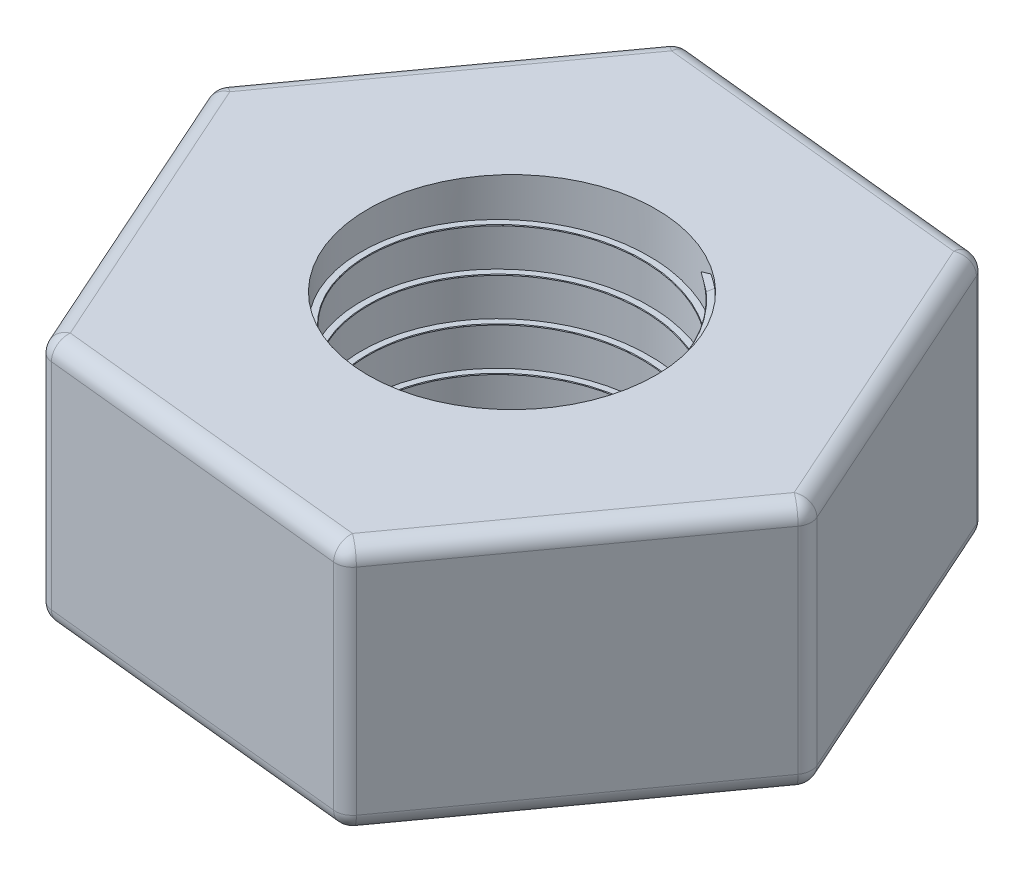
from build123d import *

# Parameters (mm, degrees)
SKETCH1_R           = 1.7018
BOSS_EXTRUDE1_DEPTH = 2.9464
SWEEP1_PITCH        = 0.508
SWEEP1_HEIGHT       = 2.873
SWEEP1_RADIUS       = 1.9558
SWEEP1_START_ANGLE  = -90
FILLET1_R           = 0.2032


with BuildPart() as part:
    # Sketch1 → Boss-Extrude1 (new body)
    with BuildSketch(Plane(origin=(0, 0, 0), x_dir=(1, 0, 0), z_dir=(0, 1, 0))):
        Polygon((1.623658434, -3.627322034), (3.953182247, -0.407531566), (2.329523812, 3.219790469), (-1.623658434, 3.627322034), (-3.953182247, 0.407531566), (-2.329523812, -3.219790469), align=None)
        with Locations(Location((0, 0, 0), (0, 0, 270))):
            Circle(SKETCH1_R, mode=Mode.SUBTRACT)
    extrude(amount=BOSS_EXTRUDE1_DEPTH)

    # Sweep1: sweep along a helix
    with BuildLine() as sweep1_path:
        add(Helix(SWEEP1_PITCH, SWEEP1_HEIGHT, SWEEP1_RADIUS, center=(0, 0, 0), direction=(0, 1, 0), mode=Mode.PRIVATE).rotate(Axis((0, 0, 0), (0, 1, 0)), SWEEP1_START_ANGLE))
    # Sketch3 → Sweep1 (sweep)
    with BuildSketch(Plane.XZ):
        Polygon((-1.613949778, -0.202547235), (-1.833668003, -0.107335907), (-1.833668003, -0.044050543), (-1.627784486, 0.090070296), align=None)
    sweep(path=sweep1_path.line, is_frenet=True)

    # Fillet1
    fillet1_edges = [part.edges().sort_by_distance(p)[0] for p in [
        (3.14135303, 2.9464, -1.406129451),
        (-2.329523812, 1.4732, 3.219790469),
        (-3.953182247, 1.4732, -0.407531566),
        (-1.623658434, 1.4732, -3.627322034),
        (2.329523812, 1.4732, -3.219790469),
        (3.953182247, 1.4732, 0.407531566),
        (1.623658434, 1.4732, 3.627322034),
        (0.352932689, 2.9464, -3.423556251),
        (-2.788420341, 2.9464, -2.0174268),
        (-3.14135303, 2.9464, 1.406129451),
        (-0.352932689, 2.9464, 3.423556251),
        (-3.14135303, 0, 1.406129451),
        (-2.788420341, 0, -2.0174268),
        (0.352932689, 0, -3.423556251),
        (2.788420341, 2.9464, 2.0174268),
        (3.14135303, 0, -1.406129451),
        (2.788420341, 0, 2.0174268),
        (-0.352932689, 0, 3.423556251),
    ]]
    fillet(fillet1_edges, radius=FILLET1_R)


solid = part.part
